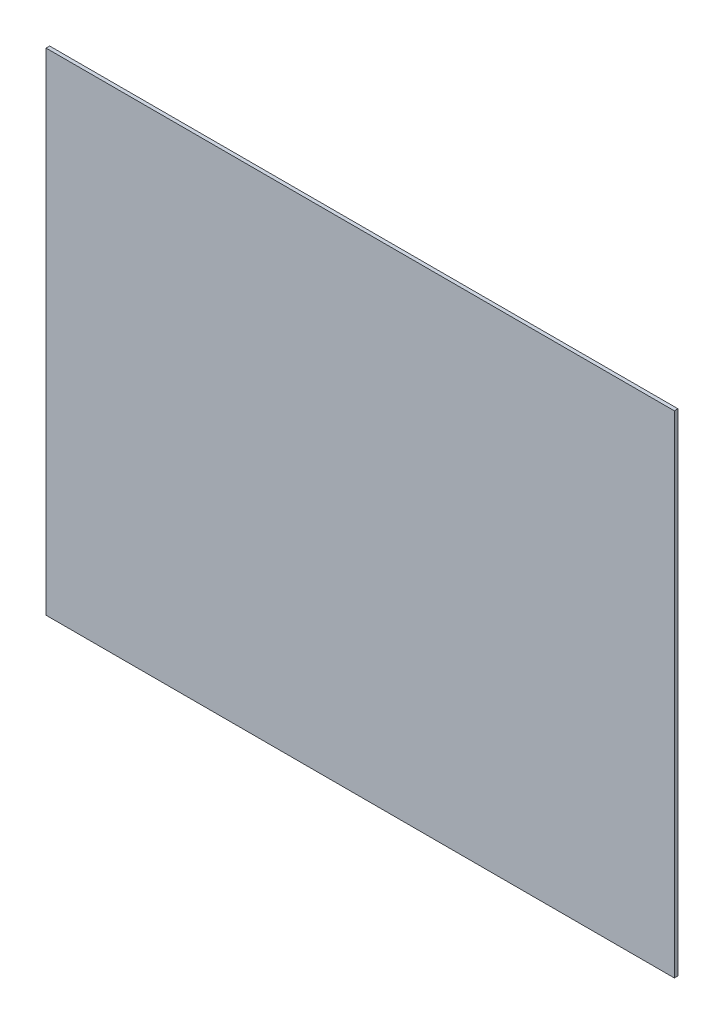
ISO-10303-21;
HEADER;
FILE_DESCRIPTION(('STEP AP214'),'2;1');
FILE_NAME('part.step','',(''),(''),'','','');
FILE_SCHEMA(('AUTOMOTIVE_DESIGN { 1 0 10303 214 1 1 1 1 }'));
ENDSEC;
DATA;
#1=APPLICATION_CONTEXT('core data for automotive mechanical design processes');
#2=APPLICATION_PROTOCOL_DEFINITION('international standard','automotive_design',2000,#1);
#3=PRODUCT_CONTEXT('',#1,'mechanical');
#4=PRODUCT('Part','Part','',(#3));
#5=PRODUCT_RELATED_PRODUCT_CATEGORY('part','',(#4));
#6=PRODUCT_DEFINITION_FORMATION('','',#4);
#7=PRODUCT_DEFINITION_CONTEXT('part definition',#1,'design');
#8=PRODUCT_DEFINITION('design','',#6,#7);
#9=PRODUCT_DEFINITION_SHAPE('','',#8);
#10=(LENGTH_UNIT() NAMED_UNIT(*) SI_UNIT(.MILLI.,.METRE.));
#11=(NAMED_UNIT(*) PLANE_ANGLE_UNIT() SI_UNIT($,.RADIAN.));
#12=(NAMED_UNIT(*) SI_UNIT($,.STERADIAN.) SOLID_ANGLE_UNIT());
#13=UNCERTAINTY_MEASURE_WITH_UNIT(LENGTH_MEASURE(1.E-05),#10,'distance_accuracy_value','');
#14=(GEOMETRIC_REPRESENTATION_CONTEXT(3) GLOBAL_UNCERTAINTY_ASSIGNED_CONTEXT((#13)) GLOBAL_UNIT_ASSIGNED_CONTEXT((#10,
#11,#12)) REPRESENTATION_CONTEXT('',''));
#15=CARTESIAN_POINT('',(0.,0.,0.));
#16=DIRECTION('',(0.,0.,1.));
#17=DIRECTION('',(1.,0.,0.));
#18=AXIS2_PLACEMENT_3D('',#15,#16,#17);
#19=CARTESIAN_POINT('',(-34.625,52.525,2.));
#20=DIRECTION('',(1.,0.,0.));
#21=DIRECTION('',(0.,1.,0.));
#22=AXIS2_PLACEMENT_3D('',#19,#20,#21);
#23=PLANE('',#22);
#24=DIRECTION('',(0.,-1.,0.));
#25=VECTOR('',#24,1.);
#26=CARTESIAN_POINT('',(-34.625,52.525,0.));
#27=LINE('',#26,#25);
#28=CARTESIAN_POINT('',(-34.625,52.525,0.));
#29=VERTEX_POINT('',#28);
#30=CARTESIAN_POINT('',(-34.625,-220.525,0.));
#31=VERTEX_POINT('',#30);
#32=EDGE_CURVE('E96',#29,#31,#27,.T.);
#33=ORIENTED_EDGE('',*,*,#32,.T.);
#34=DIRECTION('',(0.,0.,-1.));
#35=VECTOR('',#34,1.);
#36=CARTESIAN_POINT('',(-34.625,-220.525,2.));
#37=LINE('',#36,#35);
#38=CARTESIAN_POINT('',(-34.625,-220.525,2.));
#39=VERTEX_POINT('',#38);
#40=EDGE_CURVE('E11',#39,#31,#37,.T.);
#41=ORIENTED_EDGE('',*,*,#40,.F.);
#42=DIRECTION('',(0.,-1.,0.));
#43=VECTOR('',#42,1.);
#44=CARTESIAN_POINT('',(-34.625,52.525,2.));
#45=LINE('',#44,#43);
#46=CARTESIAN_POINT('',(-34.625,52.525,2.));
#47=VERTEX_POINT('',#46);
#48=EDGE_CURVE('E84',#47,#39,#45,.T.);
#49=ORIENTED_EDGE('',*,*,#48,.F.);
#50=DIRECTION('',(0.,0.,-1.));
#51=VECTOR('',#50,1.);
#52=CARTESIAN_POINT('',(-34.625,52.525,2.));
#53=LINE('',#52,#51);
#54=EDGE_CURVE('E92',#47,#29,#53,.T.);
#55=ORIENTED_EDGE('',*,*,#54,.T.);
#56=EDGE_LOOP('',(#33,#41,#49,#55));
#57=FACE_BOUND('',#56,.T.);
#58=ADVANCED_FACE('F33',(#57),#23,.F.);
#59=CARTESIAN_POINT('',(-34.625,-220.525,2.));
#60=DIRECTION('',(0.,1.,0.));
#61=DIRECTION('',(0.,0.,1.));
#62=AXIS2_PLACEMENT_3D('',#59,#60,#61);
#63=PLANE('',#62);
#64=DIRECTION('',(1.,0.,0.));
#65=VECTOR('',#64,1.);
#66=CARTESIAN_POINT('',(-34.625,-220.525,0.));
#67=LINE('',#66,#65);
#68=CARTESIAN_POINT('',(314.625,-220.525,0.));
#69=VERTEX_POINT('',#68);
#70=EDGE_CURVE('E88',#31,#69,#67,.T.);
#71=ORIENTED_EDGE('',*,*,#70,.T.);
#72=DIRECTION('',(0.,0.,-1.));
#73=VECTOR('',#72,1.);
#74=CARTESIAN_POINT('',(314.625,-220.525,2.));
#75=LINE('',#74,#73);
#76=CARTESIAN_POINT('',(314.625,-220.525,2.));
#77=VERTEX_POINT('',#76);
#78=EDGE_CURVE('E41',#77,#69,#75,.T.);
#79=ORIENTED_EDGE('',*,*,#78,.F.);
#80=DIRECTION('',(1.,0.,0.));
#81=VECTOR('',#80,1.);
#82=CARTESIAN_POINT('',(-34.625,-220.525,2.));
#83=LINE('',#82,#81);
#84=EDGE_CURVE('E79',#39,#77,#83,.T.);
#85=ORIENTED_EDGE('',*,*,#84,.F.);
#86=ORIENTED_EDGE('',*,*,#40,.T.);
#87=EDGE_LOOP('',(#71,#79,#85,#86));
#88=FACE_BOUND('',#87,.T.);
#89=ADVANCED_FACE('F87',(#88),#63,.F.);
#90=CARTESIAN_POINT('',(314.625,52.525,2.));
#91=DIRECTION('',(-1.,0.,0.));
#92=DIRECTION('',(0.,-1.,0.));
#93=AXIS2_PLACEMENT_3D('',#90,#91,#92);
#94=PLANE('',#93);
#95=DIRECTION('',(0.,1.,0.));
#96=VECTOR('',#95,1.);
#97=CARTESIAN_POINT('',(314.625,52.525,0.));
#98=LINE('',#97,#96);
#99=CARTESIAN_POINT('',(314.625,52.525,0.));
#100=VERTEX_POINT('',#99);
#101=EDGE_CURVE('E66',#69,#100,#98,.T.);
#102=ORIENTED_EDGE('',*,*,#101,.T.);
#103=DIRECTION('',(0.,0.,-1.));
#104=VECTOR('',#103,1.);
#105=CARTESIAN_POINT('',(314.625,52.525,2.));
#106=LINE('',#105,#104);
#107=CARTESIAN_POINT('',(314.625,52.525,2.));
#108=VERTEX_POINT('',#107);
#109=EDGE_CURVE('E89',#108,#100,#106,.T.);
#110=ORIENTED_EDGE('',*,*,#109,.F.);
#111=DIRECTION('',(0.,1.,0.));
#112=VECTOR('',#111,1.);
#113=CARTESIAN_POINT('',(314.625,52.525,2.));
#114=LINE('',#113,#112);
#115=EDGE_CURVE('E82',#77,#108,#114,.T.);
#116=ORIENTED_EDGE('',*,*,#115,.F.);
#117=ORIENTED_EDGE('',*,*,#78,.T.);
#118=EDGE_LOOP('',(#102,#110,#116,#117));
#119=FACE_BOUND('',#118,.T.);
#120=ADVANCED_FACE('F90',(#119),#94,.F.);
#121=CARTESIAN_POINT('',(-34.625,52.525,2.));
#122=DIRECTION('',(0.,-1.,0.));
#123=DIRECTION('',(0.,0.,-1.));
#124=AXIS2_PLACEMENT_3D('',#121,#122,#123);
#125=PLANE('',#124);
#126=DIRECTION('',(-1.,0.,0.));
#127=VECTOR('',#126,1.);
#128=CARTESIAN_POINT('',(-34.625,52.525,0.));
#129=LINE('',#128,#127);
#130=EDGE_CURVE('E72',#100,#29,#129,.T.);
#131=ORIENTED_EDGE('',*,*,#130,.T.);
#132=ORIENTED_EDGE('',*,*,#54,.F.);
#133=DIRECTION('',(-1.,0.,0.));
#134=VECTOR('',#133,1.);
#135=CARTESIAN_POINT('',(-34.625,52.525,2.));
#136=LINE('',#135,#134);
#137=EDGE_CURVE('E49',#108,#47,#136,.T.);
#138=ORIENTED_EDGE('',*,*,#137,.F.);
#139=ORIENTED_EDGE('',*,*,#109,.T.);
#140=EDGE_LOOP('',(#131,#132,#138,#139));
#141=FACE_BOUND('',#140,.T.);
#142=ADVANCED_FACE('F103',(#141),#125,.F.);
#143=CARTESIAN_POINT('',(0.,0.,2.));
#144=DIRECTION('',(0.,0.,1.));
#145=DIRECTION('',(1.,0.,0.));
#146=AXIS2_PLACEMENT_3D('',#143,#144,#145);
#147=PLANE('',#146);
#148=ORIENTED_EDGE('',*,*,#48,.T.);
#149=ORIENTED_EDGE('',*,*,#84,.T.);
#150=ORIENTED_EDGE('',*,*,#115,.T.);
#151=ORIENTED_EDGE('',*,*,#137,.T.);
#152=EDGE_LOOP('',(#148,#149,#150,#151));
#153=FACE_BOUND('',#152,.T.);
#154=ADVANCED_FACE('F80',(#153),#147,.T.);
#155=CARTESIAN_POINT('',(0.,0.,0.));
#156=DIRECTION('',(0.,0.,1.));
#157=DIRECTION('',(1.,0.,0.));
#158=AXIS2_PLACEMENT_3D('',#155,#156,#157);
#159=PLANE('',#158);
#160=ORIENTED_EDGE('',*,*,#32,.F.);
#161=ORIENTED_EDGE('',*,*,#130,.F.);
#162=ORIENTED_EDGE('',*,*,#101,.F.);
#163=ORIENTED_EDGE('',*,*,#70,.F.);
#164=EDGE_LOOP('',(#160,#161,#162,#163));
#165=FACE_BOUND('',#164,.T.);
#166=ADVANCED_FACE('F106',(#165),#159,.F.);
#167=CLOSED_SHELL('',(#58,#89,#120,#142,#154,#166));
#168=MANIFOLD_SOLID_BREP('B2',#167);
#169=ADVANCED_BREP_SHAPE_REPRESENTATION('',(#18,#168),#14);
#170=SHAPE_DEFINITION_REPRESENTATION(#9,#169);
ENDSEC;
END-ISO-10303-21;
